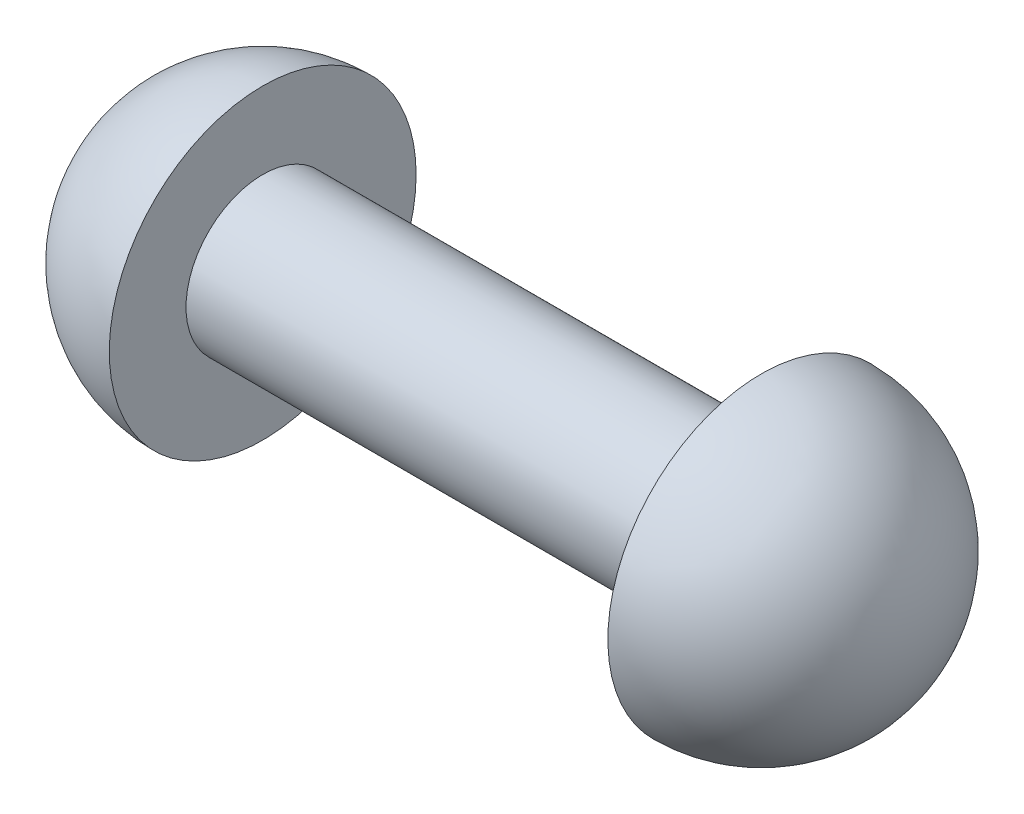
from build123d import *


with BuildPart() as part:
    # Esquisse1 → Base-R_volution (revolve)
    with BuildSketch(Plane.XY, mode=Mode.PRIVATE) as base_r_volution_sk:
        with BuildLine():
            Line((0, 8), (0, 4))
            Line((0, 4), (-26, 4))
            Line((-26, 4), (-26, 8))
            ThreePointArc((-26, 8), (-31.656854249, 5.656854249), (-34, 0))
            Line((-34, 0), (8, 0))
            ThreePointArc((8, 0), (5.656854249, 5.656854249), (0, 8))
        make_face()
    revolve(base_r_volution_sk.sketch.rotate(Axis((10.9, 0, 0), (-1, 0, 0)), 90), axis=Axis((10.9, 0, 0), (-1, 0, 0)))


solid = part.part
